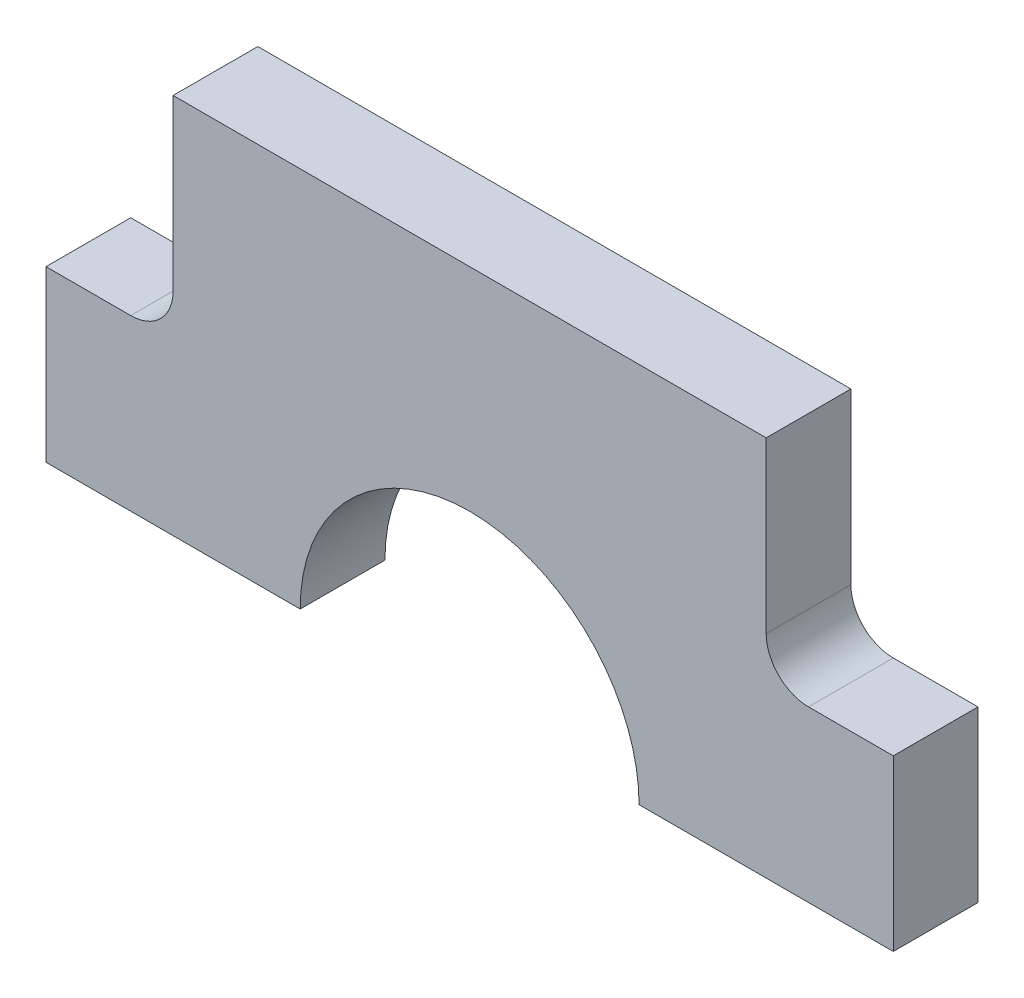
ISO-10303-21;
HEADER;
FILE_DESCRIPTION(('STEP AP214'),'2;1');
FILE_NAME('part.step','',(''),(''),'','','');
FILE_SCHEMA(('AUTOMOTIVE_DESIGN { 1 0 10303 214 1 1 1 1 }'));
ENDSEC;
DATA;
#1=APPLICATION_CONTEXT('core data for automotive mechanical design processes');
#2=APPLICATION_PROTOCOL_DEFINITION('international standard','automotive_design',2000,#1);
#3=PRODUCT_CONTEXT('',#1,'mechanical');
#4=PRODUCT('Part','Part','',(#3));
#5=PRODUCT_RELATED_PRODUCT_CATEGORY('part','',(#4));
#6=PRODUCT_DEFINITION_FORMATION('','',#4);
#7=PRODUCT_DEFINITION_CONTEXT('part definition',#1,'design');
#8=PRODUCT_DEFINITION('design','',#6,#7);
#9=PRODUCT_DEFINITION_SHAPE('','',#8);
#10=(LENGTH_UNIT() NAMED_UNIT(*) SI_UNIT(.MILLI.,.METRE.));
#11=(NAMED_UNIT(*) PLANE_ANGLE_UNIT() SI_UNIT($,.RADIAN.));
#12=(NAMED_UNIT(*) SI_UNIT($,.STERADIAN.) SOLID_ANGLE_UNIT());
#13=UNCERTAINTY_MEASURE_WITH_UNIT(LENGTH_MEASURE(1.E-05),#10,'distance_accuracy_value','');
#14=(GEOMETRIC_REPRESENTATION_CONTEXT(3) GLOBAL_UNCERTAINTY_ASSIGNED_CONTEXT((#13)) GLOBAL_UNIT_ASSIGNED_CONTEXT((#10,
#11,#12)) REPRESENTATION_CONTEXT('',''));
#15=CARTESIAN_POINT('',(0.,0.,0.));
#16=DIRECTION('',(0.,0.,1.));
#17=DIRECTION('',(1.,0.,0.));
#18=AXIS2_PLACEMENT_3D('',#15,#16,#17);
#19=CARTESIAN_POINT('',(0.,5.08,2.54));
#20=DIRECTION('',(1.,0.,0.));
#21=DIRECTION('',(0.,1.,0.));
#22=AXIS2_PLACEMENT_3D('',#19,#20,#21);
#23=PLANE('',#22);
#24=DIRECTION('',(0.,-1.,0.));
#25=VECTOR('',#24,1.);
#26=CARTESIAN_POINT('',(0.,5.08,0.));
#27=LINE('',#26,#25);
#28=CARTESIAN_POINT('',(0.,5.08,0.));
#29=VERTEX_POINT('',#28);
#30=CARTESIAN_POINT('',(0.,0.,0.));
#31=VERTEX_POINT('',#30);
#32=EDGE_CURVE('E154',#29,#31,#27,.T.);
#33=ORIENTED_EDGE('',*,*,#32,.T.);
#34=DIRECTION('',(0.,0.,-1.));
#35=VECTOR('',#34,1.);
#36=CARTESIAN_POINT('',(0.,0.,2.54));
#37=LINE('',#36,#35);
#38=CARTESIAN_POINT('',(0.,0.,2.54));
#39=VERTEX_POINT('',#38);
#40=EDGE_CURVE('E11',#39,#31,#37,.T.);
#41=ORIENTED_EDGE('',*,*,#40,.F.);
#42=DIRECTION('',(0.,-1.,0.));
#43=VECTOR('',#42,1.);
#44=CARTESIAN_POINT('',(0.,5.08,2.54));
#45=LINE('',#44,#43);
#46=CARTESIAN_POINT('',(0.,5.08,2.54));
#47=VERTEX_POINT('',#46);
#48=EDGE_CURVE('E176',#47,#39,#45,.T.);
#49=ORIENTED_EDGE('',*,*,#48,.F.);
#50=DIRECTION('',(0.,0.,-1.));
#51=VECTOR('',#50,1.);
#52=CARTESIAN_POINT('',(0.,5.08,2.54));
#53=LINE('',#52,#51);
#54=EDGE_CURVE('E150',#47,#29,#53,.T.);
#55=ORIENTED_EDGE('',*,*,#54,.T.);
#56=EDGE_LOOP('',(#33,#41,#49,#55));
#57=FACE_BOUND('',#56,.T.);
#58=ADVANCED_FACE('F34',(#57),#23,.F.);
#59=CARTESIAN_POINT('',(0.,0.,2.54));
#60=DIRECTION('',(0.,1.,0.));
#61=DIRECTION('',(0.,0.,1.));
#62=AXIS2_PLACEMENT_3D('',#59,#60,#61);
#63=PLANE('',#62);
#64=DIRECTION('',(1.,0.,0.));
#65=VECTOR('',#64,1.);
#66=CARTESIAN_POINT('',(0.,0.,0.));
#67=LINE('',#66,#65);
#68=CARTESIAN_POINT('',(7.62,0.,0.));
#69=VERTEX_POINT('',#68);
#70=EDGE_CURVE('E157',#31,#69,#67,.T.);
#71=ORIENTED_EDGE('',*,*,#70,.T.);
#72=DIRECTION('',(0.,0.,-1.));
#73=VECTOR('',#72,1.);
#74=CARTESIAN_POINT('',(7.62,0.,2.54));
#75=LINE('',#74,#73);
#76=CARTESIAN_POINT('',(7.62,0.,2.54));
#77=VERTEX_POINT('',#76);
#78=EDGE_CURVE('E42',#77,#69,#75,.T.);
#79=ORIENTED_EDGE('',*,*,#78,.F.);
#80=DIRECTION('',(1.,0.,0.));
#81=VECTOR('',#80,1.);
#82=CARTESIAN_POINT('',(0.,0.,2.54));
#83=LINE('',#82,#81);
#84=EDGE_CURVE('E105',#39,#77,#83,.T.);
#85=ORIENTED_EDGE('',*,*,#84,.F.);
#86=ORIENTED_EDGE('',*,*,#40,.T.);
#87=EDGE_LOOP('',(#71,#79,#85,#86));
#88=FACE_BOUND('',#87,.T.);
#89=ADVANCED_FACE('F254',(#88),#63,.F.);
#90=CARTESIAN_POINT('',(12.7,0.,2.54));
#91=DIRECTION('',(0.,0.,-1.));
#92=DIRECTION('',(-1.,0.,0.));
#93=AXIS2_PLACEMENT_3D('',#90,#91,#92);
#94=CYLINDRICAL_SURFACE('',#93,5.08);
#95=CARTESIAN_POINT('',(12.7,0.,0.));
#96=DIRECTION('',(0.,0.,-1.));
#97=DIRECTION('',(-1.,0.,0.));
#98=AXIS2_PLACEMENT_3D('',#95,#96,#97);
#99=CIRCLE('',#98,5.08);
#100=CARTESIAN_POINT('',(17.78,0.,0.));
#101=VERTEX_POINT('',#100);
#102=EDGE_CURVE('E159',#69,#101,#99,.T.);
#103=ORIENTED_EDGE('',*,*,#102,.T.);
#104=DIRECTION('',(0.,0.,-1.));
#105=VECTOR('',#104,1.);
#106=CARTESIAN_POINT('',(17.78,0.,2.54));
#107=LINE('',#106,#105);
#108=CARTESIAN_POINT('',(17.78,0.,2.54));
#109=VERTEX_POINT('',#108);
#110=EDGE_CURVE('E195',#109,#101,#107,.T.);
#111=ORIENTED_EDGE('',*,*,#110,.F.);
#112=CARTESIAN_POINT('',(12.7,0.,2.54));
#113=DIRECTION('',(0.,0.,-1.));
#114=DIRECTION('',(-1.,0.,0.));
#115=AXIS2_PLACEMENT_3D('',#112,#113,#114);
#116=CIRCLE('',#115,5.08);
#117=EDGE_CURVE('E203',#77,#109,#116,.T.);
#118=ORIENTED_EDGE('',*,*,#117,.F.);
#119=ORIENTED_EDGE('',*,*,#78,.T.);
#120=EDGE_LOOP('',(#103,#111,#118,#119));
#121=FACE_BOUND('',#120,.T.);
#122=ADVANCED_FACE('F201',(#121),#94,.F.);
#123=CARTESIAN_POINT('',(17.78,0.,2.54));
#124=DIRECTION('',(0.,1.,0.));
#125=DIRECTION('',(0.,0.,1.));
#126=AXIS2_PLACEMENT_3D('',#123,#124,#125);
#127=PLANE('',#126);
#128=DIRECTION('',(1.,0.,0.));
#129=VECTOR('',#128,1.);
#130=CARTESIAN_POINT('',(17.78,0.,0.));
#131=LINE('',#130,#129);
#132=CARTESIAN_POINT('',(25.4,0.,0.));
#133=VERTEX_POINT('',#132);
#134=EDGE_CURVE('E161',#101,#133,#131,.T.);
#135=ORIENTED_EDGE('',*,*,#134,.T.);
#136=DIRECTION('',(0.,0.,-1.));
#137=VECTOR('',#136,1.);
#138=CARTESIAN_POINT('',(25.4,0.,2.54));
#139=LINE('',#138,#137);
#140=CARTESIAN_POINT('',(25.4,0.,2.54));
#141=VERTEX_POINT('',#140);
#142=EDGE_CURVE('E192',#141,#133,#139,.T.);
#143=ORIENTED_EDGE('',*,*,#142,.F.);
#144=DIRECTION('',(1.,0.,0.));
#145=VECTOR('',#144,1.);
#146=CARTESIAN_POINT('',(17.78,0.,2.54));
#147=LINE('',#146,#145);
#148=EDGE_CURVE('E221',#109,#141,#147,.T.);
#149=ORIENTED_EDGE('',*,*,#148,.F.);
#150=ORIENTED_EDGE('',*,*,#110,.T.);
#151=EDGE_LOOP('',(#135,#143,#149,#150));
#152=FACE_BOUND('',#151,.T.);
#153=ADVANCED_FACE('F212',(#152),#127,.F.);
#154=CARTESIAN_POINT('',(25.4,0.,2.54));
#155=DIRECTION('',(-1.,0.,0.));
#156=DIRECTION('',(0.,0.,1.));
#157=AXIS2_PLACEMENT_3D('',#154,#155,#156);
#158=PLANE('',#157);
#159=DIRECTION('',(0.,1.,0.));
#160=VECTOR('',#159,1.);
#161=CARTESIAN_POINT('',(25.4,0.,0.));
#162=LINE('',#161,#160);
#163=CARTESIAN_POINT('',(25.4,5.08,0.));
#164=VERTEX_POINT('',#163);
#165=EDGE_CURVE('E163',#133,#164,#162,.T.);
#166=ORIENTED_EDGE('',*,*,#165,.T.);
#167=DIRECTION('',(0.,0.,-1.));
#168=VECTOR('',#167,1.);
#169=CARTESIAN_POINT('',(25.4,5.08,2.54));
#170=LINE('',#169,#168);
#171=CARTESIAN_POINT('',(25.4,5.08,2.54));
#172=VERTEX_POINT('',#171);
#173=EDGE_CURVE('E189',#172,#164,#170,.T.);
#174=ORIENTED_EDGE('',*,*,#173,.F.);
#175=DIRECTION('',(0.,1.,0.));
#176=VECTOR('',#175,1.);
#177=CARTESIAN_POINT('',(25.4,0.,2.54));
#178=LINE('',#177,#176);
#179=EDGE_CURVE('E218',#141,#172,#178,.T.);
#180=ORIENTED_EDGE('',*,*,#179,.F.);
#181=ORIENTED_EDGE('',*,*,#142,.T.);
#182=EDGE_LOOP('',(#166,#174,#180,#181));
#183=FACE_BOUND('',#182,.T.);
#184=ADVANCED_FACE('F216',(#183),#158,.F.);
#185=CARTESIAN_POINT('',(25.4,5.08,2.54));
#186=DIRECTION('',(0.,-1.,0.));
#187=DIRECTION('',(0.,0.,-1.));
#188=AXIS2_PLACEMENT_3D('',#185,#186,#187);
#189=PLANE('',#188);
#190=DIRECTION('',(-1.,0.,0.));
#191=VECTOR('',#190,1.);
#192=CARTESIAN_POINT('',(25.4,5.08,0.));
#193=LINE('',#192,#191);
#194=CARTESIAN_POINT('',(22.86,5.08,0.));
#195=VERTEX_POINT('',#194);
#196=EDGE_CURVE('E165',#164,#195,#193,.T.);
#197=ORIENTED_EDGE('',*,*,#196,.T.);
#198=DIRECTION('',(0.,0.,-1.));
#199=VECTOR('',#198,1.);
#200=CARTESIAN_POINT('',(22.86,5.08,2.54));
#201=LINE('',#200,#199);
#202=CARTESIAN_POINT('',(22.86,5.08,2.54));
#203=VERTEX_POINT('',#202);
#204=EDGE_CURVE('E186',#203,#195,#201,.T.);
#205=ORIENTED_EDGE('',*,*,#204,.F.);
#206=DIRECTION('',(-1.,0.,0.));
#207=VECTOR('',#206,1.);
#208=CARTESIAN_POINT('',(25.4,5.08,2.54));
#209=LINE('',#208,#207);
#210=EDGE_CURVE('E220',#172,#203,#209,.T.);
#211=ORIENTED_EDGE('',*,*,#210,.F.);
#212=ORIENTED_EDGE('',*,*,#173,.T.);
#213=EDGE_LOOP('',(#197,#205,#211,#212));
#214=FACE_BOUND('',#213,.T.);
#215=ADVANCED_FACE('F267',(#214),#189,.F.);
#216=CARTESIAN_POINT('',(22.86,6.35,2.54));
#217=DIRECTION('',(0.,0.,-1.));
#218=DIRECTION('',(-1.,0.,0.));
#219=AXIS2_PLACEMENT_3D('',#216,#217,#218);
#220=CYLINDRICAL_SURFACE('',#219,1.27);
#221=CARTESIAN_POINT('',(22.86,6.35,0.));
#222=DIRECTION('',(0.,0.,-1.));
#223=DIRECTION('',(-1.,0.,0.));
#224=AXIS2_PLACEMENT_3D('',#221,#222,#223);
#225=CIRCLE('',#224,1.27);
#226=CARTESIAN_POINT('',(21.59,6.35000000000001,0.));
#227=VERTEX_POINT('',#226);
#228=EDGE_CURVE('E167',#195,#227,#225,.T.);
#229=ORIENTED_EDGE('',*,*,#228,.T.);
#230=DIRECTION('',(0.,0.,-1.));
#231=VECTOR('',#230,1.);
#232=CARTESIAN_POINT('',(21.59,6.35000000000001,2.54));
#233=LINE('',#232,#231);
#234=CARTESIAN_POINT('',(21.59,6.35000000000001,2.54));
#235=VERTEX_POINT('',#234);
#236=EDGE_CURVE('E183',#235,#227,#233,.T.);
#237=ORIENTED_EDGE('',*,*,#236,.F.);
#238=CARTESIAN_POINT('',(22.86,6.35,2.54));
#239=DIRECTION('',(0.,0.,-1.));
#240=DIRECTION('',(-1.,0.,0.));
#241=AXIS2_PLACEMENT_3D('',#238,#239,#240);
#242=CIRCLE('',#241,1.27);
#243=EDGE_CURVE('E223',#203,#235,#242,.T.);
#244=ORIENTED_EDGE('',*,*,#243,.F.);
#245=ORIENTED_EDGE('',*,*,#204,.T.);
#246=EDGE_LOOP('',(#229,#237,#244,#245));
#247=FACE_BOUND('',#246,.T.);
#248=ADVANCED_FACE('F270',(#247),#220,.F.);
#249=CARTESIAN_POINT('',(21.59,6.35000000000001,2.54));
#250=DIRECTION('',(-1.,0.,0.));
#251=DIRECTION('',(0.,0.,1.));
#252=AXIS2_PLACEMENT_3D('',#249,#250,#251);
#253=PLANE('',#252);
#254=DIRECTION('',(0.,1.,0.));
#255=VECTOR('',#254,1.);
#256=CARTESIAN_POINT('',(21.59,6.35000000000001,0.));
#257=LINE('',#256,#255);
#258=CARTESIAN_POINT('',(21.59,11.43,0.));
#259=VERTEX_POINT('',#258);
#260=EDGE_CURVE('E169',#227,#259,#257,.T.);
#261=ORIENTED_EDGE('',*,*,#260,.T.);
#262=DIRECTION('',(0.,0.,-1.));
#263=VECTOR('',#262,1.);
#264=CARTESIAN_POINT('',(21.59,11.43,2.54));
#265=LINE('',#264,#263);
#266=CARTESIAN_POINT('',(21.59,11.43,2.54));
#267=VERTEX_POINT('',#266);
#268=EDGE_CURVE('E180',#267,#259,#265,.T.);
#269=ORIENTED_EDGE('',*,*,#268,.F.);
#270=DIRECTION('',(0.,1.,0.));
#271=VECTOR('',#270,1.);
#272=CARTESIAN_POINT('',(21.59,6.35000000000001,2.54));
#273=LINE('',#272,#271);
#274=EDGE_CURVE('E229',#235,#267,#273,.T.);
#275=ORIENTED_EDGE('',*,*,#274,.F.);
#276=ORIENTED_EDGE('',*,*,#236,.T.);
#277=EDGE_LOOP('',(#261,#269,#275,#276));
#278=FACE_BOUND('',#277,.T.);
#279=ADVANCED_FACE('F235',(#278),#253,.F.);
#280=CARTESIAN_POINT('',(21.59,11.43,2.54));
#281=DIRECTION('',(0.,-1.,0.));
#282=DIRECTION('',(0.,0.,-1.));
#283=AXIS2_PLACEMENT_3D('',#280,#281,#282);
#284=PLANE('',#283);
#285=DIRECTION('',(-1.,0.,0.));
#286=VECTOR('',#285,1.);
#287=CARTESIAN_POINT('',(21.59,11.43,0.));
#288=LINE('',#287,#286);
#289=CARTESIAN_POINT('',(3.81,11.43,0.));
#290=VERTEX_POINT('',#289);
#291=EDGE_CURVE('E171',#259,#290,#288,.T.);
#292=ORIENTED_EDGE('',*,*,#291,.T.);
#293=DIRECTION('',(0.,0.,-1.));
#294=VECTOR('',#293,1.);
#295=CARTESIAN_POINT('',(3.81,11.43,2.54));
#296=LINE('',#295,#294);
#297=CARTESIAN_POINT('',(3.81,11.43,2.54));
#298=VERTEX_POINT('',#297);
#299=EDGE_CURVE('E145',#298,#290,#296,.T.);
#300=ORIENTED_EDGE('',*,*,#299,.F.);
#301=DIRECTION('',(-1.,0.,0.));
#302=VECTOR('',#301,1.);
#303=CARTESIAN_POINT('',(21.59,11.43,2.54));
#304=LINE('',#303,#302);
#305=EDGE_CURVE('E136',#267,#298,#304,.T.);
#306=ORIENTED_EDGE('',*,*,#305,.F.);
#307=ORIENTED_EDGE('',*,*,#268,.T.);
#308=EDGE_LOOP('',(#292,#300,#306,#307));
#309=FACE_BOUND('',#308,.T.);
#310=ADVANCED_FACE('F239',(#309),#284,.F.);
#311=CARTESIAN_POINT('',(3.81,11.43,2.54));
#312=DIRECTION('',(1.,0.,0.));
#313=DIRECTION('',(0.,0.,-1.));
#314=AXIS2_PLACEMENT_3D('',#311,#312,#313);
#315=PLANE('',#314);
#316=DIRECTION('',(0.,-1.,0.));
#317=VECTOR('',#316,1.);
#318=CARTESIAN_POINT('',(3.81,11.43,0.));
#319=LINE('',#318,#317);
#320=CARTESIAN_POINT('',(3.81,6.35000000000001,0.));
#321=VERTEX_POINT('',#320);
#322=EDGE_CURVE('E144',#290,#321,#319,.T.);
#323=ORIENTED_EDGE('',*,*,#322,.T.);
#324=DIRECTION('',(0.,0.,-1.));
#325=VECTOR('',#324,1.);
#326=CARTESIAN_POINT('',(3.81,6.35000000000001,2.54));
#327=LINE('',#326,#325);
#328=CARTESIAN_POINT('',(3.81,6.35000000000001,2.54));
#329=VERTEX_POINT('',#328);
#330=EDGE_CURVE('E141',#329,#321,#327,.T.);
#331=ORIENTED_EDGE('',*,*,#330,.F.);
#332=DIRECTION('',(0.,-1.,0.));
#333=VECTOR('',#332,1.);
#334=CARTESIAN_POINT('',(3.81,11.43,2.54));
#335=LINE('',#334,#333);
#336=EDGE_CURVE('E130',#298,#329,#335,.T.);
#337=ORIENTED_EDGE('',*,*,#336,.F.);
#338=ORIENTED_EDGE('',*,*,#299,.T.);
#339=EDGE_LOOP('',(#323,#331,#337,#338));
#340=FACE_BOUND('',#339,.T.);
#341=ADVANCED_FACE('F142',(#340),#315,.F.);
#342=CARTESIAN_POINT('',(2.54,6.35,2.54));
#343=DIRECTION('',(0.,0.,-1.));
#344=DIRECTION('',(-1.,0.,0.));
#345=AXIS2_PLACEMENT_3D('',#342,#343,#344);
#346=CYLINDRICAL_SURFACE('',#345,1.27);
#347=CARTESIAN_POINT('',(2.54,6.35,0.));
#348=DIRECTION('',(0.,0.,-1.));
#349=DIRECTION('',(1.,0.,0.));
#350=AXIS2_PLACEMENT_3D('',#347,#348,#349);
#351=CIRCLE('',#350,1.27);
#352=CARTESIAN_POINT('',(2.53999999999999,5.08,0.));
#353=VERTEX_POINT('',#352);
#354=EDGE_CURVE('E91',#321,#353,#351,.T.);
#355=ORIENTED_EDGE('',*,*,#354,.T.);
#356=DIRECTION('',(0.,0.,-1.));
#357=VECTOR('',#356,1.);
#358=CARTESIAN_POINT('',(2.53999999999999,5.08,2.54));
#359=LINE('',#358,#357);
#360=CARTESIAN_POINT('',(2.53999999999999,5.08,2.54));
#361=VERTEX_POINT('',#360);
#362=EDGE_CURVE('E146',#361,#353,#359,.T.);
#363=ORIENTED_EDGE('',*,*,#362,.F.);
#364=CARTESIAN_POINT('',(2.54,6.35,2.54));
#365=DIRECTION('',(0.,0.,-1.));
#366=DIRECTION('',(1.,0.,0.));
#367=AXIS2_PLACEMENT_3D('',#364,#365,#366);
#368=CIRCLE('',#367,1.27);
#369=EDGE_CURVE('E134',#329,#361,#368,.T.);
#370=ORIENTED_EDGE('',*,*,#369,.F.);
#371=ORIENTED_EDGE('',*,*,#330,.T.);
#372=EDGE_LOOP('',(#355,#363,#370,#371));
#373=FACE_BOUND('',#372,.T.);
#374=ADVANCED_FACE('F148',(#373),#346,.F.);
#375=CARTESIAN_POINT('',(2.53999999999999,5.08,2.54));
#376=DIRECTION('',(0.,-1.,0.));
#377=DIRECTION('',(1.,0.,0.));
#378=AXIS2_PLACEMENT_3D('',#375,#376,#377);
#379=PLANE('',#378);
#380=DIRECTION('',(-1.,0.,0.));
#381=VECTOR('',#380,1.);
#382=CARTESIAN_POINT('',(2.53999999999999,5.08,0.));
#383=LINE('',#382,#381);
#384=EDGE_CURVE('E97',#353,#29,#383,.T.);
#385=ORIENTED_EDGE('',*,*,#384,.T.);
#386=ORIENTED_EDGE('',*,*,#54,.F.);
#387=DIRECTION('',(-1.,0.,0.));
#388=VECTOR('',#387,1.);
#389=CARTESIAN_POINT('',(2.53999999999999,5.08,2.54));
#390=LINE('',#389,#388);
#391=EDGE_CURVE('E50',#361,#47,#390,.T.);
#392=ORIENTED_EDGE('',*,*,#391,.F.);
#393=ORIENTED_EDGE('',*,*,#362,.T.);
#394=EDGE_LOOP('',(#385,#386,#392,#393));
#395=FACE_BOUND('',#394,.T.);
#396=ADVANCED_FACE('F243',(#395),#379,.F.);
#397=CARTESIAN_POINT('',(12.7,0.,2.54));
#398=DIRECTION('',(0.,0.,-1.));
#399=DIRECTION('',(-1.,0.,0.));
#400=AXIS2_PLACEMENT_3D('',#397,#398,#399);
#401=PLANE('',#400);
#402=ORIENTED_EDGE('',*,*,#48,.T.);
#403=ORIENTED_EDGE('',*,*,#84,.T.);
#404=ORIENTED_EDGE('',*,*,#117,.T.);
#405=ORIENTED_EDGE('',*,*,#148,.T.);
#406=ORIENTED_EDGE('',*,*,#179,.T.);
#407=ORIENTED_EDGE('',*,*,#210,.T.);
#408=ORIENTED_EDGE('',*,*,#243,.T.);
#409=ORIENTED_EDGE('',*,*,#274,.T.);
#410=ORIENTED_EDGE('',*,*,#305,.T.);
#411=ORIENTED_EDGE('',*,*,#336,.T.);
#412=ORIENTED_EDGE('',*,*,#369,.T.);
#413=ORIENTED_EDGE('',*,*,#391,.T.);
#414=EDGE_LOOP('',(#402,#403,#404,#405,#406,#407,#408,#409,#410,#411,#412,#413));
#415=FACE_BOUND('',#414,.T.);
#416=ADVANCED_FACE('F132',(#415),#401,.F.);
#417=CARTESIAN_POINT('',(12.7,0.,0.));
#418=DIRECTION('',(0.,0.,-1.));
#419=DIRECTION('',(-1.,0.,0.));
#420=AXIS2_PLACEMENT_3D('',#417,#418,#419);
#421=PLANE('',#420);
#422=ORIENTED_EDGE('',*,*,#32,.F.);
#423=ORIENTED_EDGE('',*,*,#384,.F.);
#424=ORIENTED_EDGE('',*,*,#354,.F.);
#425=ORIENTED_EDGE('',*,*,#322,.F.);
#426=ORIENTED_EDGE('',*,*,#291,.F.);
#427=ORIENTED_EDGE('',*,*,#260,.F.);
#428=ORIENTED_EDGE('',*,*,#228,.F.);
#429=ORIENTED_EDGE('',*,*,#196,.F.);
#430=ORIENTED_EDGE('',*,*,#165,.F.);
#431=ORIENTED_EDGE('',*,*,#134,.F.);
#432=ORIENTED_EDGE('',*,*,#102,.F.);
#433=ORIENTED_EDGE('',*,*,#70,.F.);
#434=EDGE_LOOP('',(#422,#423,#424,#425,#426,#427,#428,#429,#430,#431,#432,#433));
#435=FACE_BOUND('',#434,.T.);
#436=ADVANCED_FACE('F207',(#435),#421,.T.);
#437=CLOSED_SHELL('',(#58,#89,#122,#153,#184,#215,#248,#279,#310,#341,#374,#396,#416,#436));
#438=MANIFOLD_SOLID_BREP('B2',#437);
#439=ADVANCED_BREP_SHAPE_REPRESENTATION('',(#18,#438),#14);
#440=SHAPE_DEFINITION_REPRESENTATION(#9,#439);
ENDSEC;
END-ISO-10303-21;
